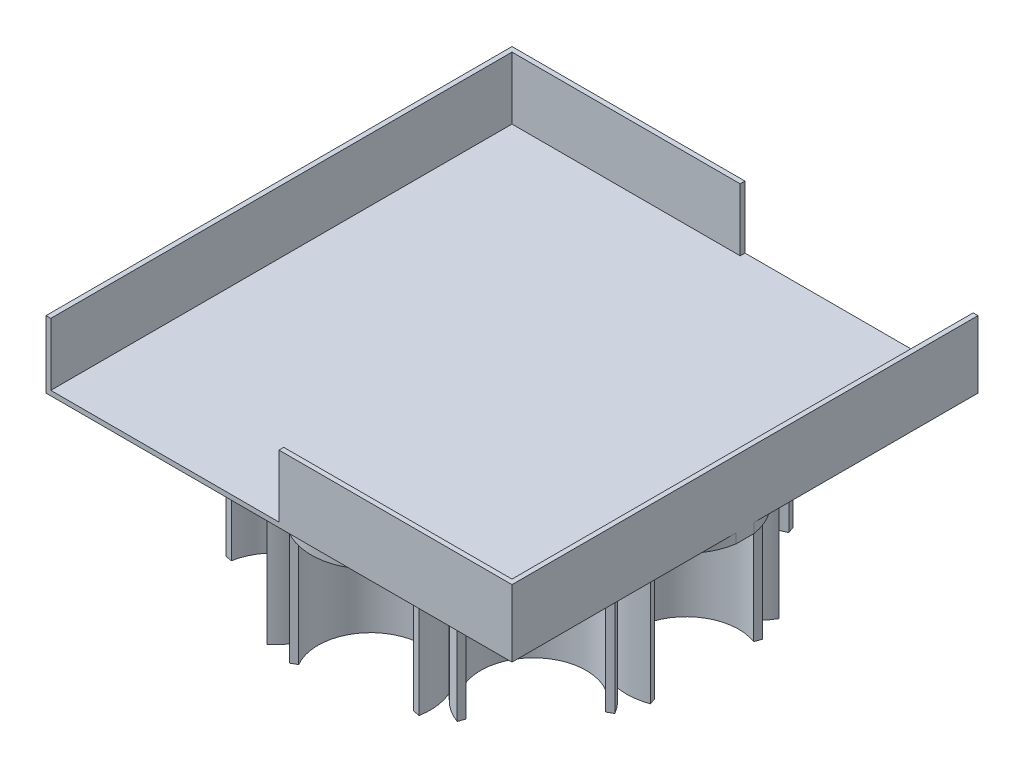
from build123d import *

# Parameters (mm, degrees)
SKETCH1_W           = 123.3805
SKETCH1_H           = 123.3805
BOSS_EXTRUDE1_DEPTH = 1.27
BOSS_EXTRUDE3_DEPTH = 17.78
SKETCH4_R           = 15.76832
SKETCH4_R_2         = 13.97
BOSS_EXTRUDE7_DEPTH = 38.1
BOSS_EXTRUDE9_DEPTH = 2.54


with BuildPart() as part:
    # Sketch1 → Boss-Extrude1 (new body)
    with BuildSketch(Plane(origin=(0, 0, 0), x_dir=(1, 0, 0), z_dir=(0, 1, 0))):
        with Locations((-3.882603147, -13.481260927)):
            Rectangle(SKETCH1_W, SKETCH1_H)
    extrude(amount=BOSS_EXTRUDE1_DEPTH)

    # Sketch3 → Boss-Extrude3 (add)
    with BuildSketch(Plane(origin=(0, 0, 0), x_dir=(1, 0, 0), z_dir=(0, 1, 0))):
        Polygon((-64.302853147, -75.171510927), (-64.302853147, -73.90151082), (-64.302853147, 46.93898918), (-3.882603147, 46.93898918), (-3.882603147, 48.208989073), (-65.572853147, 48.208989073), (-65.572853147, -75.171510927), align=None)
        Polygon((56.537646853, -73.90151082), (-3.882603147, -73.90151082), (-3.882603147, -75.171510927), (57.807646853, -75.171510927), (57.807646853, 48.208989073), (56.537646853, 48.208989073), (56.537646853, 46.93898918), align=None)
    extrude(amount=BOSS_EXTRUDE3_DEPTH)

    # Sketch4 → Boss-Extrude7 (add)
    # profile 1 of 10: a face of its own
    with BuildSketch(Plane.XZ):
        with Locations(Location((-3.882603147, 13.481260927, 0), (0, 0, 90))):
            Circle(SKETCH4_R)
        with Locations(Location((-3.882603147, 13.481260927, 0), (0, 0, 90))):
            Circle(SKETCH4_R_2, mode=Mode.SUBTRACT)
    # profile 2 of 10: a face of its own
    with BuildSketch(Plane.XZ):
        with BuildLine():
            ThreePointArc((43.528230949, -9.164410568), (20.728215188, -7.169667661), (26.651834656, -29.276916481))
            Line((26.651834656, -29.276916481), (26.036772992, -30.966784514))
            ThreePointArc((26.036772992, -30.966784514), (19.350622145, -6.013729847), (45.085621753, -8.265250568))
            Line((45.085621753, -8.265250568), (43.528230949, -9.164410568))
        make_face()
    # profile 3 of 10: a face of its own
    with BuildSketch(Plane.XZ):
        with BuildLine():
            ThreePointArc((46.992559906, 26.608766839), (28.244538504, 13.481260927), (46.992559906, 0.353755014))
            Line((46.992559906, 0.353755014), (47.60762157, -1.33611302))
            ThreePointArc((47.60762157, -1.33611302), (26.446218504, 13.481260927), (47.60762157, 28.298634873))
            Line((47.60762157, 28.298634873), (46.992559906, 26.608766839))
        make_face()
    # profile 4 of 10: a face of its own
    with BuildSketch(Plane.XZ):
        with BuildLine():
            ThreePointArc((26.651834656, 56.239438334), (20.728215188, 34.132189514), (43.528230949, 36.126932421))
            Line((43.528230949, 36.126932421), (45.085621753, 35.227772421))
            ThreePointArc((45.085621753, 35.227772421), (19.350622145, 32.9762517), (26.036772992, 57.929306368))
            Line((26.036772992, 57.929306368), (26.651834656, 56.239438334))
        make_face()
    # profile 5 of 10: a face of its own
    with BuildSketch(Plane.XZ):
        with BuildLine():
            ThreePointArc((-9.533684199, 66.762243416), (1.383941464, 43.349319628), (19.650845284, 61.616223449))
            Line((19.650845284, 61.616223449), (17.879845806, 61.303948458))
            ThreePointArc((17.879845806, 61.303948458), (1.696216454, 45.120319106), (-7.976293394, 65.863083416))
            Line((-7.976293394, 65.863083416), (-9.533684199, 66.762243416))
        make_face()
    # profile 6 of 10: a face of its own
    with BuildSketch(Plane.XZ):
        with BuildLine():
            ThreePointArc((-42.45993776, 50.664416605), (-19.047013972, 39.746790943), (-16.795493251, 65.481790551))
            Line((-16.795493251, 65.481790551), (-17.951431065, 64.104197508))
            ThreePointArc((-17.951431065, 64.104197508), (-19.946173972, 41.304181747), (-40.688938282, 50.976691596))
            Line((-40.688938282, 50.976691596), (-42.45993776, 50.664416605))
        make_face()
    # profile 7 of 10: a face of its own
    with BuildSketch(Plane.XZ):
        with BuildLine():
            ThreePointArc((-56.179489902, 18.54577105), (-34.072241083, 24.469390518), (-47.199746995, 43.217411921))
            Line((-47.199746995, 43.217411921), (-47.199746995, 45.015731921))
            ThreePointArc((-47.199746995, 45.015731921), (-32.382373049, 23.854328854), (-57.335427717, 17.168178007))
            Line((-57.335427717, 17.168178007), (-56.179489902, 18.54577105))
        make_face()
    # profile 8 of 10: a face of its own
    with BuildSketch(Plane.XZ):
        with BuildLine():
            ThreePointArc((-47.199746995, -16.254890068), (-34.072241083, 2.493131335), (-56.179489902, 8.416750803))
            Line((-56.179489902, 8.416750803), (-57.335427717, 9.794343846))
            ThreePointArc((-57.335427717, 9.794343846), (-32.382373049, 3.108192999), (-47.199746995, -18.053210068))
            Line((-47.199746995, -18.053210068), (-47.199746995, -16.254890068))
        make_face()
    # profile 9 of 10: a face of its own
    with BuildSketch(Plane.XZ):
        with BuildLine():
            ThreePointArc((-16.795493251, -38.519268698), (-19.047013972, -12.78426909), (-42.45993776, -23.701894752))
            Line((-42.45993776, -23.701894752), (-40.688938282, -24.014169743))
            ThreePointArc((-40.688938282, -24.014169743), (-19.946173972, -14.341659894), (-17.951431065, -37.141675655))
            Line((-17.951431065, -37.141675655), (-16.795493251, -38.519268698))
        make_face()
    # profile 10 of 10: a face of its own
    with BuildSketch(Plane.XZ):
        with BuildLine():
            ThreePointArc((17.879845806, -34.341426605), (1.696216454, -18.157797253), (-7.976293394, -38.900561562))
            Line((-7.976293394, -38.900561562), (-9.533684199, -39.799721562))
            ThreePointArc((-9.533684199, -39.799721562), (1.383941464, -16.386797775), (19.650845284, -34.653701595))
            Line((19.650845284, -34.653701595), (17.879845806, -34.341426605))
        make_face()
    extrude(amount=BOSS_EXTRUDE7_DEPTH)

    # Sketch5 → Boss-Extrude9 (add)
    with BuildSketch(Plane.XZ):
        with BuildLine():
            ThreePointArc((-9.533684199, -39.799721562), (6.860221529, -47.44432535), (19.650845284, -34.653701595))
            Line((19.650845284, -34.653701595), (17.879845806, -34.341426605))
            ThreePointArc((17.879845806, -34.341426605), (6.547946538, -45.673325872), (-7.976293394, -38.900561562))
            Line((-7.976293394, -38.900561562), (-9.533684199, -39.799721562))
        make_face()
        with BuildLine():
            ThreePointArc((47.198176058, -16.149410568), (46.660883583, -12.068269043), (45.085621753, -8.265250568))
            Line((45.085621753, -8.265250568), (43.528230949, -9.164410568))
            ThreePointArc((43.528230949, -9.164410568), (44.923839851, -12.533708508), (45.399856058, -16.149410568))
            ThreePointArc((45.399856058, -16.149410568), (39.442718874, -27.592964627), (26.651834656, -29.276916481))
            Line((26.651834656, -29.276916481), (26.036772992, -30.966784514))
            ThreePointArc((26.036772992, -30.966784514), (40.474192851, -29.066062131), (47.198176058, -16.149410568))
        make_face()
        with BuildLine():
            ThreePointArc((57.807646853, 15.82537859), (54.421118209, 23.463211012), (47.60762157, 28.298634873))
            Line((47.60762157, 28.298634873), (46.992559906, 26.608766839))
            ThreePointArc((46.992559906, 26.608766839), (53.658092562, 21.494123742), (56.184538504, 13.481260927))
            ThreePointArc((56.184538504, 13.481260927), (53.658092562, 5.468398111), (46.992559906, 0.353755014))
            Line((46.992559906, 0.353755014), (47.60762157, -1.33611302))
            ThreePointArc((47.60762157, -1.33611302), (54.421118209, 3.499310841), (57.807646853, 11.137143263))
            Line((57.807646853, 11.137143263), (57.807646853, 15.82537859))
        make_face()
        with BuildLine():
            ThreePointArc((45.085621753, 35.227772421), (46.660883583, 39.030790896), (47.198176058, 43.111932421))
            ThreePointArc((47.198176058, 43.111932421), (40.474192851, 56.028583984), (26.036772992, 57.929306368))
            Line((26.036772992, 57.929306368), (26.651834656, 56.239438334))
            ThreePointArc((26.651834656, 56.239438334), (39.442718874, 54.55548648), (45.399856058, 43.111932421))
            ThreePointArc((45.399856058, 43.111932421), (44.923839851, 39.496230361), (43.528230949, 36.126932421))
            Line((43.528230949, 36.126932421), (45.085621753, 35.227772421))
        make_face()
        with BuildLine():
            Line((17.879845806, 61.303948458), (19.650845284, 61.616223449))
            ThreePointArc((19.650845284, 61.616223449), (6.860221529, 74.406847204), (-9.533684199, 66.762243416))
            Line((-9.533684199, 66.762243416), (-7.976293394, 65.863083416))
            ThreePointArc((-7.976293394, 65.863083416), (6.547946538, 72.635847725), (17.879845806, 61.303948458))
        make_face()
        with BuildLine():
            Line((-17.951431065, 64.104197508), (-16.795493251, 65.481790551))
            ThreePointArc((-16.795493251, 65.481790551), (-34.815333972, 67.058322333), (-42.45993776, 50.664416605))
            Line((-42.45993776, 50.664416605), (-40.688938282, 50.976691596))
            ThreePointArc((-40.688938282, 50.976691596), (-33.916173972, 65.500931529), (-17.951431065, 64.104197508))
        make_face()
        with BuildLine():
            Line((-47.199746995, 43.217411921), (-47.199746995, 45.015731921))
            ThreePointArc((-47.199746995, 45.015731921), (-62.017120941, 34.640494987), (-57.335427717, 17.168178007))
            Line((-57.335427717, 17.168178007), (-56.179489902, 18.54577105))
            ThreePointArc((-56.179489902, 18.54577105), (-60.327252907, 34.025433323), (-47.199746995, 43.217411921))
        make_face()
        with BuildLine():
            Line((-56.179489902, 8.416750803), (-57.335427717, 9.794343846))
            ThreePointArc((-57.335427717, 9.794343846), (-62.017120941, -7.677973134), (-47.199746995, -18.053210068))
            Line((-47.199746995, -18.053210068), (-47.199746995, -16.254890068))
            ThreePointArc((-47.199746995, -16.254890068), (-60.327252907, -7.06291147), (-56.179489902, 8.416750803))
        make_face()
        with BuildLine():
            ThreePointArc((-42.45993776, -23.701894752), (-34.815333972, -40.09580048), (-16.795493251, -38.519268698))
            Line((-16.795493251, -38.519268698), (-17.951431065, -37.141675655))
            ThreePointArc((-17.951431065, -37.141675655), (-33.916173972, -38.538409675), (-40.688938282, -24.014169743))
            Line((-40.688938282, -24.014169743), (-42.45993776, -23.701894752))
        make_face()
    extrude(amount=BOSS_EXTRUDE9_DEPTH)


solid = part.part
